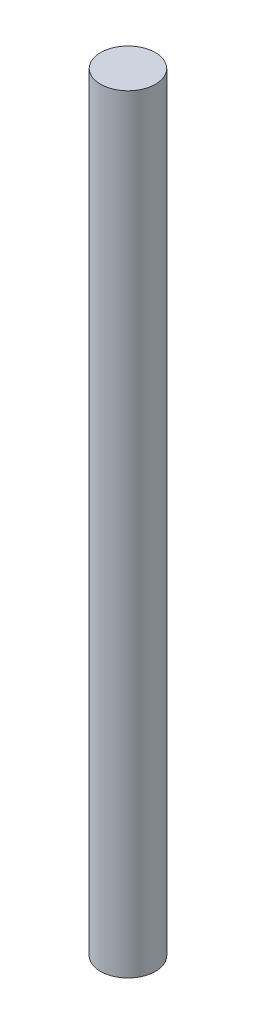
from build123d import *

# Parameters (mm, degrees)
SKETCH1_R      = 3.175
EXTRUDE1_DEPTH = 88.9


with BuildPart() as part:
    # Sketch1 → Extrude1 (new body)
    with BuildSketch(Plane(origin=(0, 0, 0), x_dir=(1, 0, 0), z_dir=(0, 1, 0))):
        with Locations(Location((0, 0, 0), (0, 0, 270))):
            Circle(SKETCH1_R)
    extrude(amount=EXTRUDE1_DEPTH)


solid = part.part
